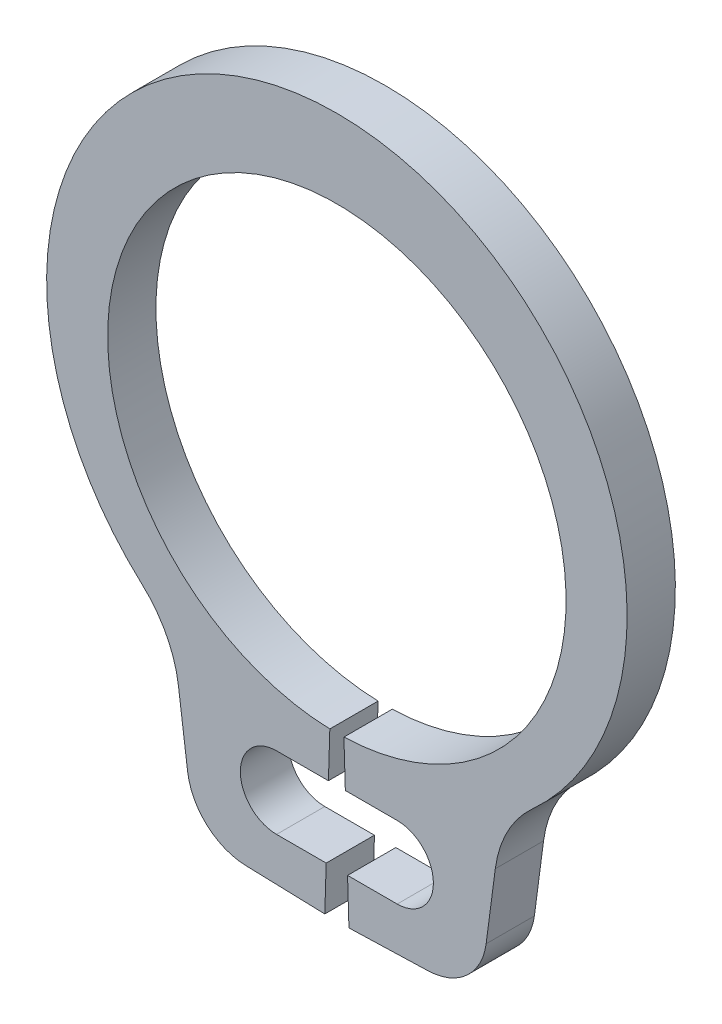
ISO-10303-21;
HEADER;
FILE_DESCRIPTION(('STEP AP214'),'2;1');
FILE_NAME('part.step','',(''),(''),'','','');
FILE_SCHEMA(('AUTOMOTIVE_DESIGN { 1 0 10303 214 1 1 1 1 }'));
ENDSEC;
DATA;
#1=APPLICATION_CONTEXT('core data for automotive mechanical design processes');
#2=APPLICATION_PROTOCOL_DEFINITION('international standard','automotive_design',2000,#1);
#3=PRODUCT_CONTEXT('',#1,'mechanical');
#4=PRODUCT('Part','Part','',(#3));
#5=PRODUCT_RELATED_PRODUCT_CATEGORY('part','',(#4));
#6=PRODUCT_DEFINITION_FORMATION('','',#4);
#7=PRODUCT_DEFINITION_CONTEXT('part definition',#1,'design');
#8=PRODUCT_DEFINITION('design','',#6,#7);
#9=PRODUCT_DEFINITION_SHAPE('','',#8);
#10=(LENGTH_UNIT() NAMED_UNIT(*) SI_UNIT(.MILLI.,.METRE.));
#11=(NAMED_UNIT(*) PLANE_ANGLE_UNIT() SI_UNIT($,.RADIAN.));
#12=(NAMED_UNIT(*) SI_UNIT($,.STERADIAN.) SOLID_ANGLE_UNIT());
#13=UNCERTAINTY_MEASURE_WITH_UNIT(LENGTH_MEASURE(1.E-05),#10,'distance_accuracy_value','');
#14=(GEOMETRIC_REPRESENTATION_CONTEXT(3) GLOBAL_UNCERTAINTY_ASSIGNED_CONTEXT((#13)) GLOBAL_UNIT_ASSIGNED_CONTEXT((#10,
#11,#12)) REPRESENTATION_CONTEXT('',''));
#15=CARTESIAN_POINT('',(0.,0.,0.));
#16=DIRECTION('',(0.,0.,1.));
#17=DIRECTION('',(1.,0.,0.));
#18=AXIS2_PLACEMENT_3D('',#15,#16,#17);
#19=CARTESIAN_POINT('',(-0.0584615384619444,-1.89910037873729,-0.400000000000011));
#20=DIRECTION('',(0.999526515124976,-0.0307692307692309,0.));
#21=DIRECTION('',(0.0307692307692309,0.999526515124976,0.));
#22=AXIS2_PLACEMENT_3D('',#19,#20,#21);
#23=PLANE('',#22);
#24=DIRECTION('',(0.,0.,1.));
#25=VECTOR('',#24,1.);
#26=CARTESIAN_POINT('',(-0.0700929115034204,-2.27694101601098,-0.400000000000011));
#27=LINE('',#26,#25);
#28=CARTESIAN_POINT('',(-0.0700929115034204,-2.27694101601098,-0.400000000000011));
#29=VERTEX_POINT('',#28);
#30=CARTESIAN_POINT('',(-0.0700929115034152,-2.27694101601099,0.));
#31=VERTEX_POINT('',#30);
#32=EDGE_CURVE('E197',#29,#31,#27,.T.);
#33=ORIENTED_EDGE('',*,*,#32,.F.);
#34=DIRECTION('',(0.0307692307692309,0.999526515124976,0.));
#35=VECTOR('',#34,1.);
#36=CARTESIAN_POINT('',(-0.0584615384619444,-1.89910037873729,-0.400000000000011));
#37=LINE('',#36,#35);
#38=CARTESIAN_POINT('',(-0.0584615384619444,-1.89910037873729,-0.400000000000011));
#39=VERTEX_POINT('',#38);
#40=EDGE_CURVE('E279',#29,#39,#37,.T.);
#41=ORIENTED_EDGE('',*,*,#40,.T.);
#42=DIRECTION('',(0.,0.,1.));
#43=VECTOR('',#42,1.);
#44=CARTESIAN_POINT('',(-0.0584615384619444,-1.89910037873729,-0.400000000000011));
#45=LINE('',#44,#43);
#46=CARTESIAN_POINT('',(-0.0584615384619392,-1.89910037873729,0.));
#47=VERTEX_POINT('',#46);
#48=EDGE_CURVE('E11',#39,#47,#45,.T.);
#49=ORIENTED_EDGE('',*,*,#48,.T.);
#50=DIRECTION('',(0.0307692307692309,0.999526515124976,0.));
#51=VECTOR('',#50,1.);
#52=CARTESIAN_POINT('',(-0.0584615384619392,-1.89910037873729,0.));
#53=LINE('',#52,#51);
#54=EDGE_CURVE('E243',#31,#47,#53,.T.);
#55=ORIENTED_EDGE('',*,*,#54,.F.);
#56=EDGE_LOOP('',(#33,#41,#49,#55));
#57=FACE_BOUND('',#56,.T.);
#58=ADVANCED_FACE('F30',(#57),#23,.T.);
#59=CARTESIAN_POINT('',(0.0584615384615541,-1.89910037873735,-0.400000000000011));
#60=DIRECTION('',(-0.999526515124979,-0.0307692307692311,0.));
#61=DIRECTION('',(0.0307692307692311,-0.99952651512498,0.));
#62=AXIS2_PLACEMENT_3D('',#59,#60,#61);
#63=PLANE('',#62);
#64=DIRECTION('',(0.,0.,-1.));
#65=VECTOR('',#64,1.);
#66=CARTESIAN_POINT('',(0.0700929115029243,-2.27694101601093,-0.400000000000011));
#67=LINE('',#66,#65);
#68=CARTESIAN_POINT('',(0.0700929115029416,-2.27694101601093,0.));
#69=VERTEX_POINT('',#68);
#70=CARTESIAN_POINT('',(0.0700929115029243,-2.27694101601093,-0.400000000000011));
#71=VERTEX_POINT('',#70);
#72=EDGE_CURVE('E201',#69,#71,#67,.T.);
#73=ORIENTED_EDGE('',*,*,#72,.F.);
#74=DIRECTION('',(0.0307692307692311,-0.99952651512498,0.));
#75=VECTOR('',#74,1.);
#76=CARTESIAN_POINT('',(0.058461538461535,-1.89910037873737,0.));
#77=LINE('',#76,#75);
#78=CARTESIAN_POINT('',(0.058461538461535,-1.89910037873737,0.));
#79=VERTEX_POINT('',#78);
#80=EDGE_CURVE('E214',#79,#69,#77,.T.);
#81=ORIENTED_EDGE('',*,*,#80,.F.);
#82=DIRECTION('',(0.,0.,1.));
#83=VECTOR('',#82,1.);
#84=CARTESIAN_POINT('',(0.0584615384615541,-1.89910037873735,-0.400000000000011));
#85=LINE('',#84,#83);
#86=CARTESIAN_POINT('',(0.0584615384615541,-1.89910037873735,-0.400000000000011));
#87=VERTEX_POINT('',#86);
#88=EDGE_CURVE('E34',#87,#79,#85,.T.);
#89=ORIENTED_EDGE('',*,*,#88,.F.);
#90=DIRECTION('',(0.0307692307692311,-0.99952651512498,0.));
#91=VECTOR('',#90,1.);
#92=CARTESIAN_POINT('',(0.0584615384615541,-1.89910037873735,-0.400000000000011));
#93=LINE('',#92,#91);
#94=EDGE_CURVE('E249',#87,#71,#93,.T.);
#95=ORIENTED_EDGE('',*,*,#94,.T.);
#96=EDGE_LOOP('',(#73,#81,#89,#95));
#97=FACE_BOUND('',#96,.T.);
#98=ADVANCED_FACE('F313',(#97),#63,.T.);
#99=CARTESIAN_POINT('',(0.,0.,-0.400000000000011));
#100=DIRECTION('',(0.,0.,1.));
#101=DIRECTION('',(1.00000000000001,0.,0.));
#102=AXIS2_PLACEMENT_3D('',#99,#100,#101);
#103=CYLINDRICAL_SURFACE('',#102,1.9);
#104=CARTESIAN_POINT('',(0.,0.,0.));
#105=DIRECTION('',(0.,0.,-1.));
#106=DIRECTION('',(1.00000000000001,0.,0.));
#107=AXIS2_PLACEMENT_3D('',#104,#105,#106);
#108=CIRCLE('',#107,1.9);
#109=EDGE_CURVE('E210',#47,#79,#108,.T.);
#110=ORIENTED_EDGE('',*,*,#109,.F.);
#111=ORIENTED_EDGE('',*,*,#48,.F.);
#112=CARTESIAN_POINT('',(0.,0.,-0.400000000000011));
#113=DIRECTION('',(0.,0.,-1.));
#114=DIRECTION('',(1.00000000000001,0.,0.));
#115=AXIS2_PLACEMENT_3D('',#112,#113,#114);
#116=CIRCLE('',#115,1.9);
#117=EDGE_CURVE('E245',#39,#87,#116,.T.);
#118=ORIENTED_EDGE('',*,*,#117,.T.);
#119=ORIENTED_EDGE('',*,*,#88,.T.);
#120=EDGE_LOOP('',(#110,#111,#118,#119));
#121=FACE_BOUND('',#120,.T.);
#122=ADVANCED_FACE('F32',(#121),#103,.F.);
#123=DIRECTION('',(0.,0.,-1.));
#124=VECTOR('',#123,1.);
#125=CARTESIAN_POINT('',(-0.0885631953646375,-2.87694101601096,-0.400000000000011));
#126=LINE('',#125,#124);
#127=CARTESIAN_POINT('',(-0.0885631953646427,-2.87694101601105,0.));
#128=VERTEX_POINT('',#127);
#129=CARTESIAN_POINT('',(-0.0885631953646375,-2.87694101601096,-0.400000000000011));
#130=VERTEX_POINT('',#129);
#131=EDGE_CURVE('E335',#128,#130,#126,.T.);
#132=ORIENTED_EDGE('',*,*,#131,.F.);
#133=CARTESIAN_POINT('',(-0.100000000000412,-3.2484611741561,0.));
#134=VERTEX_POINT('',#133);
#135=EDGE_CURVE('E191',#134,#128,#53,.T.);
#136=ORIENTED_EDGE('',*,*,#135,.F.);
#137=DIRECTION('',(0.,0.,1.));
#138=VECTOR('',#137,1.);
#139=CARTESIAN_POINT('',(-0.100000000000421,-3.24846117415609,-0.400000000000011));
#140=LINE('',#139,#138);
#141=CARTESIAN_POINT('',(-0.100000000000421,-3.24846117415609,-0.400000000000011));
#142=VERTEX_POINT('',#141);
#143=EDGE_CURVE('E39',#142,#134,#140,.T.);
#144=ORIENTED_EDGE('',*,*,#143,.F.);
#145=EDGE_CURVE('E280',#142,#130,#37,.T.);
#146=ORIENTED_EDGE('',*,*,#145,.T.);
#147=EDGE_LOOP('',(#132,#136,#144,#146));
#148=FACE_BOUND('',#147,.T.);
#149=ADVANCED_FACE('F344',(#148),#23,.T.);
#150=CARTESIAN_POINT('',(-0.100000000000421,-3.24846117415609,-0.400000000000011));
#151=DIRECTION('',(-0.030769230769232,-0.999526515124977,0.));
#152=DIRECTION('',(0.999526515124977,-0.030769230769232,0.));
#153=AXIS2_PLACEMENT_3D('',#150,#151,#152);
#154=PLANE('',#153);
#155=DIRECTION('',(0.999526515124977,-0.030769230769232,0.));
#156=VECTOR('',#155,1.);
#157=CARTESIAN_POINT('',(-0.100000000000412,-3.2484611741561,0.));
#158=LINE('',#157,#156);
#159=CARTESIAN_POINT('',(-0.756909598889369,-3.22823899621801,0.));
#160=VERTEX_POINT('',#159);
#161=EDGE_CURVE('E241',#160,#134,#158,.T.);
#162=ORIENTED_EDGE('',*,*,#161,.F.);
#163=DIRECTION('',(0.,0.,1.));
#164=VECTOR('',#163,1.);
#165=CARTESIAN_POINT('',(-0.756909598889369,-3.22823899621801,-0.400000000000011));
#166=LINE('',#165,#164);
#167=CARTESIAN_POINT('',(-0.756909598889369,-3.22823899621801,-0.400000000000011));
#168=VERTEX_POINT('',#167);
#169=EDGE_CURVE('E284',#168,#160,#166,.T.);
#170=ORIENTED_EDGE('',*,*,#169,.F.);
#171=DIRECTION('',(0.999526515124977,-0.030769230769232,0.));
#172=VECTOR('',#171,1.);
#173=CARTESIAN_POINT('',(-0.100000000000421,-3.24846117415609,-0.400000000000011));
#174=LINE('',#173,#172);
#175=EDGE_CURVE('E276',#168,#142,#174,.T.);
#176=ORIENTED_EDGE('',*,*,#175,.T.);
#177=ORIENTED_EDGE('',*,*,#143,.T.);
#178=EDGE_LOOP('',(#162,#170,#176,#177));
#179=FACE_BOUND('',#178,.T.);
#180=ADVANCED_FACE('F347',(#179),#154,.T.);
#181=CARTESIAN_POINT('',(-0.741524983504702,-2.72847573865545,-0.400000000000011));
#182=DIRECTION('',(0.,0.,1.));
#183=DIRECTION('',(1.00000000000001,0.,0.));
#184=AXIS2_PLACEMENT_3D('',#181,#182,#183);
#185=CYLINDRICAL_SURFACE('',#184,0.5);
#186=CARTESIAN_POINT('',(-0.741524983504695,-2.72847573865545,0.));
#187=DIRECTION('',(0.,0.,1.));
#188=DIRECTION('',(1.00000000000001,0.,0.));
#189=AXIS2_PLACEMENT_3D('',#186,#187,#188);
#190=CIRCLE('',#189,0.5);
#191=CARTESIAN_POINT('',(-1.23724741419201,-2.79373883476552,0.));
#192=VERTEX_POINT('',#191);
#193=EDGE_CURVE('E238',#192,#160,#190,.T.);
#194=ORIENTED_EDGE('',*,*,#193,.F.);
#195=DIRECTION('',(0.,0.,1.));
#196=VECTOR('',#195,1.);
#197=CARTESIAN_POINT('',(-1.23724741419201,-2.79373883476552,-0.400000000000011));
#198=LINE('',#197,#196);
#199=CARTESIAN_POINT('',(-1.23724741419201,-2.79373883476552,-0.400000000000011));
#200=VERTEX_POINT('',#199);
#201=EDGE_CURVE('E286',#200,#192,#198,.T.);
#202=ORIENTED_EDGE('',*,*,#201,.F.);
#203=CARTESIAN_POINT('',(-0.741524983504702,-2.72847573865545,-0.400000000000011));
#204=DIRECTION('',(0.,0.,1.));
#205=DIRECTION('',(1.00000000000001,0.,0.));
#206=AXIS2_PLACEMENT_3D('',#203,#204,#205);
#207=CIRCLE('',#206,0.5);
#208=EDGE_CURVE('E273',#200,#168,#207,.T.);
#209=ORIENTED_EDGE('',*,*,#208,.T.);
#210=ORIENTED_EDGE('',*,*,#169,.T.);
#211=EDGE_LOOP('',(#194,#202,#209,#210));
#212=FACE_BOUND('',#211,.T.);
#213=ADVANCED_FACE('F352',(#212),#185,.T.);
#214=CARTESIAN_POINT('',(-1.31317772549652,-2.21699086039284,-0.400000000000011));
#215=DIRECTION('',(-0.99144486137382,-0.130526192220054,0.));
#216=DIRECTION('',(0.130526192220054,-0.99144486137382,0.));
#217=AXIS2_PLACEMENT_3D('',#214,#215,#216);
#218=PLANE('',#217);
#219=DIRECTION('',(0.130526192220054,-0.99144486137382,0.));
#220=VECTOR('',#219,1.);
#221=CARTESIAN_POINT('',(-1.31317772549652,-2.21699086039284,0.));
#222=LINE('',#221,#220);
#223=CARTESIAN_POINT('',(-1.31317772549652,-2.21699086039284,0.));
#224=VERTEX_POINT('',#223);
#225=EDGE_CURVE('E235',#224,#192,#222,.T.);
#226=ORIENTED_EDGE('',*,*,#225,.F.);
#227=DIRECTION('',(0.,0.,1.));
#228=VECTOR('',#227,1.);
#229=CARTESIAN_POINT('',(-1.31317772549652,-2.21699086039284,-0.400000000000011));
#230=LINE('',#229,#228);
#231=CARTESIAN_POINT('',(-1.31317772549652,-2.21699086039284,-0.400000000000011));
#232=VERTEX_POINT('',#231);
#233=EDGE_CURVE('E288',#232,#224,#230,.T.);
#234=ORIENTED_EDGE('',*,*,#233,.F.);
#235=DIRECTION('',(0.130526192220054,-0.99144486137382,0.));
#236=VECTOR('',#235,1.);
#237=CARTESIAN_POINT('',(-1.31317772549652,-2.21699086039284,-0.400000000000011));
#238=LINE('',#237,#236);
#239=EDGE_CURVE('E270',#232,#200,#238,.T.);
#240=ORIENTED_EDGE('',*,*,#239,.T.);
#241=ORIENTED_EDGE('',*,*,#201,.T.);
#242=EDGE_LOOP('',(#226,#234,#240,#241));
#243=FACE_BOUND('',#242,.T.);
#244=ADVANCED_FACE('F355',(#243),#218,.T.);
#245=CARTESIAN_POINT('',(-2.25446708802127,-2.34091395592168,-0.400000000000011));
#246=DIRECTION('',(0.,0.,1.));
#247=DIRECTION('',(1.00000000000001,0.,0.));
#248=AXIS2_PLACEMENT_3D('',#245,#246,#247);
#249=CYLINDRICAL_SURFACE('',#248,0.94941171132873);
#250=CARTESIAN_POINT('',(-2.25446708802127,-2.34091395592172,0.));
#251=DIRECTION('',(0.,0.,-1.));
#252=DIRECTION('',(1.00000000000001,0.,0.));
#253=AXIS2_PLACEMENT_3D('',#250,#251,#252);
#254=CIRCLE('',#253,0.94941171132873);
#255=CARTESIAN_POINT('',(-1.61654471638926,-1.63775135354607,0.));
#256=VERTEX_POINT('',#255);
#257=EDGE_CURVE('E232',#256,#224,#254,.T.);
#258=ORIENTED_EDGE('',*,*,#257,.F.);
#259=DIRECTION('',(0.,0.,1.));
#260=VECTOR('',#259,1.);
#261=CARTESIAN_POINT('',(-1.61654471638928,-1.63775135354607,-0.400000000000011));
#262=LINE('',#261,#260);
#263=CARTESIAN_POINT('',(-1.61654471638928,-1.63775135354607,-0.400000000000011));
#264=VERTEX_POINT('',#263);
#265=EDGE_CURVE('E290',#264,#256,#262,.T.);
#266=ORIENTED_EDGE('',*,*,#265,.F.);
#267=CARTESIAN_POINT('',(-2.25446708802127,-2.34091395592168,-0.400000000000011));
#268=DIRECTION('',(0.,0.,-1.));
#269=DIRECTION('',(1.00000000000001,0.,0.));
#270=AXIS2_PLACEMENT_3D('',#267,#268,#269);
#271=CIRCLE('',#270,0.94941171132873);
#272=EDGE_CURVE('E267',#264,#232,#271,.T.);
#273=ORIENTED_EDGE('',*,*,#272,.T.);
#274=ORIENTED_EDGE('',*,*,#233,.T.);
#275=EDGE_LOOP('',(#258,#266,#273,#274));
#276=FACE_BOUND('',#275,.T.);
#277=ADVANCED_FACE('F360',(#276),#249,.F.);
#278=CARTESIAN_POINT('',(-4.18068357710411E-13,0.144117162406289,-0.400000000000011));
#279=DIRECTION('',(0.,0.,1.));
#280=DIRECTION('',(1.00000000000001,0.,0.));
#281=AXIS2_PLACEMENT_3D('',#278,#279,#280);
#282=CYLINDRICAL_SURFACE('',#281,2.40588283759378);
#283=CARTESIAN_POINT('',(-4.02455846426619E-13,0.144117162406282,0.));
#284=DIRECTION('',(0.,0.,1.));
#285=DIRECTION('',(1.00000000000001,0.,0.));
#286=AXIS2_PLACEMENT_3D('',#283,#284,#285);
#287=CIRCLE('',#286,2.40588283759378);
#288=CARTESIAN_POINT('',(1.61654471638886,-1.6377513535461,0.));
#289=VERTEX_POINT('',#288);
#290=EDGE_CURVE('E229',#289,#256,#287,.T.);
#291=ORIENTED_EDGE('',*,*,#290,.F.);
#292=DIRECTION('',(0.,0.,1.));
#293=VECTOR('',#292,1.);
#294=CARTESIAN_POINT('',(1.61654471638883,-1.6377513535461,-0.400000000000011));
#295=LINE('',#294,#293);
#296=CARTESIAN_POINT('',(1.61654471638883,-1.6377513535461,-0.400000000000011));
#297=VERTEX_POINT('',#296);
#298=EDGE_CURVE('E292',#297,#289,#295,.T.);
#299=ORIENTED_EDGE('',*,*,#298,.F.);
#300=CARTESIAN_POINT('',(-4.18068357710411E-13,0.144117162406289,-0.400000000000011));
#301=DIRECTION('',(0.,0.,1.));
#302=DIRECTION('',(1.00000000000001,0.,0.));
#303=AXIS2_PLACEMENT_3D('',#300,#301,#302);
#304=CIRCLE('',#303,2.40588283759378);
#305=EDGE_CURVE('E264',#297,#264,#304,.T.);
#306=ORIENTED_EDGE('',*,*,#305,.T.);
#307=ORIENTED_EDGE('',*,*,#265,.T.);
#308=EDGE_LOOP('',(#291,#299,#306,#307));
#309=FACE_BOUND('',#308,.T.);
#310=ADVANCED_FACE('F363',(#309),#282,.T.);
#311=CARTESIAN_POINT('',(2.2544670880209,-2.34091395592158,-0.400000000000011));
#312=DIRECTION('',(0.,0.,1.));
#313=DIRECTION('',(1.00000000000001,0.,0.));
#314=AXIS2_PLACEMENT_3D('',#311,#312,#313);
#315=CYLINDRICAL_SURFACE('',#314,0.94941171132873);
#316=CARTESIAN_POINT('',(2.2544670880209,-2.34091395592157,0.));
#317=DIRECTION('',(0.,0.,-1.));
#318=DIRECTION('',(1.00000000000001,0.,0.));
#319=AXIS2_PLACEMENT_3D('',#316,#317,#318);
#320=CIRCLE('',#319,0.94941171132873);
#321=CARTESIAN_POINT('',(1.3131777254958,-2.21699086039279,0.));
#322=VERTEX_POINT('',#321);
#323=EDGE_CURVE('E226',#322,#289,#320,.T.);
#324=ORIENTED_EDGE('',*,*,#323,.F.);
#325=DIRECTION('',(0.,0.,1.));
#326=VECTOR('',#325,1.);
#327=CARTESIAN_POINT('',(1.31317772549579,-2.21699086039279,-0.400000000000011));
#328=LINE('',#327,#326);
#329=CARTESIAN_POINT('',(1.31317772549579,-2.21699086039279,-0.400000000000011));
#330=VERTEX_POINT('',#329);
#331=EDGE_CURVE('E294',#330,#322,#328,.T.);
#332=ORIENTED_EDGE('',*,*,#331,.F.);
#333=CARTESIAN_POINT('',(2.2544670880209,-2.34091395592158,-0.400000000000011));
#334=DIRECTION('',(0.,0.,-1.));
#335=DIRECTION('',(1.00000000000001,0.,0.));
#336=AXIS2_PLACEMENT_3D('',#333,#334,#335);
#337=CIRCLE('',#336,0.94941171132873);
#338=EDGE_CURVE('E261',#330,#297,#337,.T.);
#339=ORIENTED_EDGE('',*,*,#338,.T.);
#340=ORIENTED_EDGE('',*,*,#298,.T.);
#341=EDGE_LOOP('',(#324,#332,#339,#340));
#342=FACE_BOUND('',#341,.T.);
#343=ADVANCED_FACE('F368',(#342),#315,.F.);
#344=CARTESIAN_POINT('',(1.31317772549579,-2.21699086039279,-0.400000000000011));
#345=DIRECTION('',(0.991444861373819,-0.130526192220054,0.));
#346=DIRECTION('',(0.130526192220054,0.991444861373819,0.));
#347=AXIS2_PLACEMENT_3D('',#344,#345,#346);
#348=PLANE('',#347);
#349=DIRECTION('',(0.130526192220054,0.991444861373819,0.));
#350=VECTOR('',#349,1.);
#351=CARTESIAN_POINT('',(1.3131777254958,-2.21699086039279,0.));
#352=LINE('',#351,#350);
#353=CARTESIAN_POINT('',(1.23724741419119,-2.79373883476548,0.));
#354=VERTEX_POINT('',#353);
#355=EDGE_CURVE('E223',#354,#322,#352,.T.);
#356=ORIENTED_EDGE('',*,*,#355,.F.);
#357=DIRECTION('',(0.,0.,1.));
#358=VECTOR('',#357,1.);
#359=CARTESIAN_POINT('',(1.23724741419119,-2.79373883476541,-0.400000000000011));
#360=LINE('',#359,#358);
#361=CARTESIAN_POINT('',(1.23724741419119,-2.79373883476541,-0.400000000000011));
#362=VERTEX_POINT('',#361);
#363=EDGE_CURVE('E296',#362,#354,#360,.T.);
#364=ORIENTED_EDGE('',*,*,#363,.F.);
#365=DIRECTION('',(0.130526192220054,0.991444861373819,0.));
#366=VECTOR('',#365,1.);
#367=CARTESIAN_POINT('',(1.31317772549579,-2.21699086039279,-0.400000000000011));
#368=LINE('',#367,#366);
#369=EDGE_CURVE('E258',#362,#330,#368,.T.);
#370=ORIENTED_EDGE('',*,*,#369,.T.);
#371=ORIENTED_EDGE('',*,*,#331,.T.);
#372=EDGE_LOOP('',(#356,#364,#370,#371));
#373=FACE_BOUND('',#372,.T.);
#374=ADVANCED_FACE('F371',(#373),#348,.T.);
#375=CARTESIAN_POINT('',(0.741524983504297,-2.72847573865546,-0.400000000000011));
#376=DIRECTION('',(0.,0.,1.));
#377=DIRECTION('',(1.00000000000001,0.,0.));
#378=AXIS2_PLACEMENT_3D('',#375,#376,#377);
#379=CYLINDRICAL_SURFACE('',#378,0.5);
#380=CARTESIAN_POINT('',(0.741524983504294,-2.72847573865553,0.));
#381=DIRECTION('',(0.,0.,1.));
#382=DIRECTION('',(-1.00000000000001,0.,0.));
#383=AXIS2_PLACEMENT_3D('',#380,#381,#382);
#384=CIRCLE('',#383,0.5);
#385=CARTESIAN_POINT('',(0.756909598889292,-3.22823899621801,0.));
#386=VERTEX_POINT('',#385);
#387=EDGE_CURVE('E220',#386,#354,#384,.T.);
#388=ORIENTED_EDGE('',*,*,#387,.F.);
#389=DIRECTION('',(0.,0.,1.));
#390=VECTOR('',#389,1.);
#391=CARTESIAN_POINT('',(0.756909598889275,-3.22823899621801,-0.400000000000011));
#392=LINE('',#391,#390);
#393=CARTESIAN_POINT('',(0.756909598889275,-3.22823899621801,-0.400000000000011));
#394=VERTEX_POINT('',#393);
#395=EDGE_CURVE('E298',#394,#386,#392,.T.);
#396=ORIENTED_EDGE('',*,*,#395,.F.);
#397=CARTESIAN_POINT('',(0.741524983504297,-2.72847573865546,-0.400000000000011));
#398=DIRECTION('',(0.,0.,1.));
#399=DIRECTION('',(-1.00000000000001,0.,0.));
#400=AXIS2_PLACEMENT_3D('',#397,#398,#399);
#401=CIRCLE('',#400,0.5);
#402=EDGE_CURVE('E255',#394,#362,#401,.T.);
#403=ORIENTED_EDGE('',*,*,#402,.T.);
#404=ORIENTED_EDGE('',*,*,#363,.T.);
#405=EDGE_LOOP('',(#388,#396,#403,#404));
#406=FACE_BOUND('',#405,.T.);
#407=ADVANCED_FACE('F376',(#406),#379,.T.);
#408=CARTESIAN_POINT('',(0.0999999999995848,-3.24846117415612,-0.400000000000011));
#409=DIRECTION('',(0.0307692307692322,-0.99952651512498,0.));
#410=DIRECTION('',(0.99952651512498,0.0307692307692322,0.));
#411=AXIS2_PLACEMENT_3D('',#408,#409,#410);
#412=PLANE('',#411);
#413=DIRECTION('',(0.999526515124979,0.0307692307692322,0.));
#414=VECTOR('',#413,1.);
#415=CARTESIAN_POINT('',(0.0999999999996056,-3.24846117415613,0.));
#416=LINE('',#415,#414);
#417=CARTESIAN_POINT('',(0.0999999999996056,-3.24846117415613,0.));
#418=VERTEX_POINT('',#417);
#419=EDGE_CURVE('E217',#418,#386,#416,.T.);
#420=ORIENTED_EDGE('',*,*,#419,.F.);
#421=DIRECTION('',(0.,0.,1.));
#422=VECTOR('',#421,1.);
#423=CARTESIAN_POINT('',(0.0999999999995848,-3.24846117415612,-0.400000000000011));
#424=LINE('',#423,#422);
#425=CARTESIAN_POINT('',(0.0999999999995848,-3.24846117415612,-0.400000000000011));
#426=VERTEX_POINT('',#425);
#427=EDGE_CURVE('E299',#426,#418,#424,.T.);
#428=ORIENTED_EDGE('',*,*,#427,.F.);
#429=DIRECTION('',(0.999526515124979,0.0307692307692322,0.));
#430=VECTOR('',#429,1.);
#431=CARTESIAN_POINT('',(0.0999999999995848,-3.24846117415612,-0.400000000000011));
#432=LINE('',#431,#430);
#433=EDGE_CURVE('E252',#426,#394,#432,.T.);
#434=ORIENTED_EDGE('',*,*,#433,.T.);
#435=ORIENTED_EDGE('',*,*,#395,.T.);
#436=EDGE_LOOP('',(#420,#428,#434,#435));
#437=FACE_BOUND('',#436,.T.);
#438=ADVANCED_FACE('F378',(#437),#412,.T.);
#439=DIRECTION('',(0.,0.,1.));
#440=VECTOR('',#439,1.);
#441=CARTESIAN_POINT('',(0.088563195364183,-2.87694101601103,-0.400000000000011));
#442=LINE('',#441,#440);
#443=CARTESIAN_POINT('',(0.088563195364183,-2.87694101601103,-0.400000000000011));
#444=VERTEX_POINT('',#443);
#445=CARTESIAN_POINT('',(0.0885631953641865,-2.87694101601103,0.));
#446=VERTEX_POINT('',#445);
#447=EDGE_CURVE('E331',#444,#446,#442,.T.);
#448=ORIENTED_EDGE('',*,*,#447,.F.);
#449=EDGE_CURVE('E248',#444,#426,#93,.T.);
#450=ORIENTED_EDGE('',*,*,#449,.T.);
#451=ORIENTED_EDGE('',*,*,#427,.T.);
#452=EDGE_CURVE('E213',#446,#418,#77,.T.);
#453=ORIENTED_EDGE('',*,*,#452,.F.);
#454=EDGE_LOOP('',(#448,#450,#451,#453));
#455=FACE_BOUND('',#454,.T.);
#456=ADVANCED_FACE('F381',(#455),#63,.T.);
#457=CARTESIAN_POINT('',(0.,0.,-0.400000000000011));
#458=DIRECTION('',(0.,0.,1.));
#459=DIRECTION('',(1.00000000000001,0.,0.));
#460=AXIS2_PLACEMENT_3D('',#457,#458,#459);
#461=PLANE('',#460);
#462=CARTESIAN_POINT('',(0.499999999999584,-2.57694101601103,-0.400000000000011));
#463=DIRECTION('',(0.,0.,1.));
#464=DIRECTION('',(1.00000000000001,0.,0.));
#465=AXIS2_PLACEMENT_3D('',#462,#463,#464);
#466=CIRCLE('',#465,0.3);
#467=CARTESIAN_POINT('',(0.499999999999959,-2.87694101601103,-0.400000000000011));
#468=VERTEX_POINT('',#467);
#469=CARTESIAN_POINT('',(0.49999999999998,-2.27694101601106,-0.400000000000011));
#470=VERTEX_POINT('',#469);
#471=EDGE_CURVE('E207',#468,#470,#466,.T.);
#472=ORIENTED_EDGE('',*,*,#471,.T.);
#473=DIRECTION('',(-1.00000000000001,0.,0.));
#474=VECTOR('',#473,1.);
#475=CARTESIAN_POINT('',(-0.500000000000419,-2.27694101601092,-0.400000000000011));
#476=LINE('',#475,#474);
#477=EDGE_CURVE('E55',#470,#71,#476,.T.);
#478=ORIENTED_EDGE('',*,*,#477,.T.);
#479=ORIENTED_EDGE('',*,*,#94,.F.);
#480=ORIENTED_EDGE('',*,*,#117,.F.);
#481=ORIENTED_EDGE('',*,*,#40,.F.);
#482=CARTESIAN_POINT('',(-0.500000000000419,-2.27694101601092,-0.400000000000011));
#483=VERTEX_POINT('',#482);
#484=EDGE_CURVE('E192',#29,#483,#476,.T.);
#485=ORIENTED_EDGE('',*,*,#484,.T.);
#486=CARTESIAN_POINT('',(-0.500000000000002,-2.57694101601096,-0.400000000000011));
#487=DIRECTION('',(0.,0.,1.));
#488=DIRECTION('',(1.00000000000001,0.,0.));
#489=AXIS2_PLACEMENT_3D('',#486,#487,#488);
#490=CIRCLE('',#489,0.3);
#491=CARTESIAN_POINT('',(-0.500000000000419,-2.87694101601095,-0.400000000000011));
#492=VERTEX_POINT('',#491);
#493=EDGE_CURVE('E196',#483,#492,#490,.T.);
#494=ORIENTED_EDGE('',*,*,#493,.T.);
#495=DIRECTION('',(1.00000000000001,0.,0.));
#496=VECTOR('',#495,1.);
#497=CARTESIAN_POINT('',(0.499999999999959,-2.87694101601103,-0.400000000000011));
#498=LINE('',#497,#496);
#499=EDGE_CURVE('E174',#492,#130,#498,.T.);
#500=ORIENTED_EDGE('',*,*,#499,.T.);
#501=ORIENTED_EDGE('',*,*,#145,.F.);
#502=ORIENTED_EDGE('',*,*,#175,.F.);
#503=ORIENTED_EDGE('',*,*,#208,.F.);
#504=ORIENTED_EDGE('',*,*,#239,.F.);
#505=ORIENTED_EDGE('',*,*,#272,.F.);
#506=ORIENTED_EDGE('',*,*,#305,.F.);
#507=ORIENTED_EDGE('',*,*,#338,.F.);
#508=ORIENTED_EDGE('',*,*,#369,.F.);
#509=ORIENTED_EDGE('',*,*,#402,.F.);
#510=ORIENTED_EDGE('',*,*,#433,.F.);
#511=ORIENTED_EDGE('',*,*,#449,.F.);
#512=EDGE_CURVE('E324',#444,#468,#498,.T.);
#513=ORIENTED_EDGE('',*,*,#512,.T.);
#514=EDGE_LOOP('',(#472,#478,#479,#480,#481,#485,#494,#500,#501,#502,#503,#504,#505,#506,#507,
#508,#509,#510,#511,#513));
#515=FACE_BOUND('',#514,.T.);
#516=ADVANCED_FACE('F320',(#515),#461,.F.);
#517=CARTESIAN_POINT('',(0.,0.,0.));
#518=DIRECTION('',(0.,0.,1.));
#519=DIRECTION('',(1.00000000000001,0.,0.));
#520=AXIS2_PLACEMENT_3D('',#517,#518,#519);
#521=PLANE('',#520);
#522=DIRECTION('',(-1.00000000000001,0.,0.));
#523=VECTOR('',#522,1.);
#524=CARTESIAN_POINT('',(-0.500000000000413,-2.27694101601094,0.));
#525=LINE('',#524,#523);
#526=CARTESIAN_POINT('',(0.49999999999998,-2.27694101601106,0.));
#527=VERTEX_POINT('',#526);
#528=EDGE_CURVE('E337',#527,#69,#525,.T.);
#529=ORIENTED_EDGE('',*,*,#528,.F.);
#530=CARTESIAN_POINT('',(0.499999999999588,-2.57694101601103,0.));
#531=DIRECTION('',(0.,0.,1.));
#532=DIRECTION('',(1.00000000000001,0.,0.));
#533=AXIS2_PLACEMENT_3D('',#530,#531,#532);
#534=CIRCLE('',#533,0.3);
#535=CARTESIAN_POINT('',(0.499999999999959,-2.87694101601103,0.));
#536=VERTEX_POINT('',#535);
#537=EDGE_CURVE('E199',#536,#527,#534,.T.);
#538=ORIENTED_EDGE('',*,*,#537,.F.);
#539=DIRECTION('',(1.00000000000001,0.,0.));
#540=VECTOR('',#539,1.);
#541=CARTESIAN_POINT('',(0.499999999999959,-2.87694101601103,0.));
#542=LINE('',#541,#540);
#543=EDGE_CURVE('E47',#446,#536,#542,.T.);
#544=ORIENTED_EDGE('',*,*,#543,.F.);
#545=ORIENTED_EDGE('',*,*,#452,.T.);
#546=ORIENTED_EDGE('',*,*,#419,.T.);
#547=ORIENTED_EDGE('',*,*,#387,.T.);
#548=ORIENTED_EDGE('',*,*,#355,.T.);
#549=ORIENTED_EDGE('',*,*,#323,.T.);
#550=ORIENTED_EDGE('',*,*,#290,.T.);
#551=ORIENTED_EDGE('',*,*,#257,.T.);
#552=ORIENTED_EDGE('',*,*,#225,.T.);
#553=ORIENTED_EDGE('',*,*,#193,.T.);
#554=ORIENTED_EDGE('',*,*,#161,.T.);
#555=ORIENTED_EDGE('',*,*,#135,.T.);
#556=CARTESIAN_POINT('',(-0.500000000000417,-2.87694101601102,0.));
#557=VERTEX_POINT('',#556);
#558=EDGE_CURVE('E171',#557,#128,#542,.T.);
#559=ORIENTED_EDGE('',*,*,#558,.F.);
#560=CARTESIAN_POINT('',(-0.500000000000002,-2.57694101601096,0.));
#561=DIRECTION('',(0.,0.,1.));
#562=DIRECTION('',(1.00000000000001,0.,0.));
#563=AXIS2_PLACEMENT_3D('',#560,#561,#562);
#564=CIRCLE('',#563,0.3);
#565=CARTESIAN_POINT('',(-0.500000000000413,-2.27694101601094,0.));
#566=VERTEX_POINT('',#565);
#567=EDGE_CURVE('E188',#566,#557,#564,.T.);
#568=ORIENTED_EDGE('',*,*,#567,.F.);
#569=EDGE_CURVE('E315',#31,#566,#525,.T.);
#570=ORIENTED_EDGE('',*,*,#569,.F.);
#571=ORIENTED_EDGE('',*,*,#54,.T.);
#572=ORIENTED_EDGE('',*,*,#109,.T.);
#573=ORIENTED_EDGE('',*,*,#80,.T.);
#574=EDGE_LOOP('',(#529,#538,#544,#545,#546,#547,#548,#549,#550,#551,#552,#553,#554,#555,#559,
#568,#570,#571,#572,#573));
#575=FACE_BOUND('',#574,.T.);
#576=ADVANCED_FACE('F186',(#575),#521,.T.);
#577=CARTESIAN_POINT('',(0.499999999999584,-2.57694101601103,-0.400000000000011));
#578=DIRECTION('',(0.,0.,1.));
#579=DIRECTION('',(1.00000000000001,0.,0.));
#580=AXIS2_PLACEMENT_3D('',#577,#578,#579);
#581=CYLINDRICAL_SURFACE('',#580,0.3);
#582=ORIENTED_EDGE('',*,*,#537,.T.);
#583=DIRECTION('',(0.,0.,1.));
#584=VECTOR('',#583,1.);
#585=CARTESIAN_POINT('',(0.49999999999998,-2.27694101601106,-0.400000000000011));
#586=LINE('',#585,#584);
#587=EDGE_CURVE('E329',#470,#527,#586,.T.);
#588=ORIENTED_EDGE('',*,*,#587,.F.);
#589=ORIENTED_EDGE('',*,*,#471,.F.);
#590=DIRECTION('',(0.,0.,1.));
#591=VECTOR('',#590,1.);
#592=CARTESIAN_POINT('',(0.499999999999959,-2.87694101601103,-0.400000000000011));
#593=LINE('',#592,#591);
#594=EDGE_CURVE('E179',#468,#536,#593,.T.);
#595=ORIENTED_EDGE('',*,*,#594,.T.);
#596=EDGE_LOOP('',(#582,#588,#589,#595));
#597=FACE_BOUND('',#596,.T.);
#598=ADVANCED_FACE('F384',(#597),#581,.F.);
#599=CARTESIAN_POINT('',(-0.500000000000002,-2.57694101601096,-0.400000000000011));
#600=DIRECTION('',(0.,0.,1.));
#601=DIRECTION('',(1.00000000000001,0.,0.));
#602=AXIS2_PLACEMENT_3D('',#599,#600,#601);
#603=CYLINDRICAL_SURFACE('',#602,0.3);
#604=ORIENTED_EDGE('',*,*,#567,.T.);
#605=DIRECTION('',(0.,0.,1.));
#606=VECTOR('',#605,1.);
#607=CARTESIAN_POINT('',(-0.500000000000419,-2.87694101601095,-0.400000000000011));
#608=LINE('',#607,#606);
#609=EDGE_CURVE('E168',#492,#557,#608,.T.);
#610=ORIENTED_EDGE('',*,*,#609,.F.);
#611=ORIENTED_EDGE('',*,*,#493,.F.);
#612=DIRECTION('',(0.,0.,1.));
#613=VECTOR('',#612,1.);
#614=CARTESIAN_POINT('',(-0.500000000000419,-2.27694101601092,-0.400000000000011));
#615=LINE('',#614,#613);
#616=EDGE_CURVE('E180',#483,#566,#615,.T.);
#617=ORIENTED_EDGE('',*,*,#616,.T.);
#618=EDGE_LOOP('',(#604,#610,#611,#617));
#619=FACE_BOUND('',#618,.T.);
#620=ADVANCED_FACE('F195',(#619),#603,.F.);
#621=CARTESIAN_POINT('',(-0.500000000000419,-2.27694101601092,-0.400000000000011));
#622=DIRECTION('',(0.,1.00000000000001,0.));
#623=DIRECTION('',(0.,0.,1.));
#624=AXIS2_PLACEMENT_3D('',#621,#622,#623);
#625=PLANE('',#624);
#626=ORIENTED_EDGE('',*,*,#32,.T.);
#627=ORIENTED_EDGE('',*,*,#569,.T.);
#628=ORIENTED_EDGE('',*,*,#616,.F.);
#629=ORIENTED_EDGE('',*,*,#484,.F.);
#630=EDGE_LOOP('',(#626,#627,#628,#629));
#631=FACE_BOUND('',#630,.T.);
#632=ADVANCED_FACE('F340',(#631),#625,.F.);
#633=CARTESIAN_POINT('',(0.499999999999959,-2.87694101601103,-0.400000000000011));
#634=DIRECTION('',(0.,-1.00000000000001,0.));
#635=DIRECTION('',(0.,0.,-1.));
#636=AXIS2_PLACEMENT_3D('',#633,#634,#635);
#637=PLANE('',#636);
#638=ORIENTED_EDGE('',*,*,#131,.T.);
#639=ORIENTED_EDGE('',*,*,#499,.F.);
#640=ORIENTED_EDGE('',*,*,#609,.T.);
#641=ORIENTED_EDGE('',*,*,#558,.T.);
#642=EDGE_LOOP('',(#638,#639,#640,#641));
#643=FACE_BOUND('',#642,.T.);
#644=ADVANCED_FACE('F170',(#643),#637,.F.);
#645=ORIENTED_EDGE('',*,*,#447,.T.);
#646=ORIENTED_EDGE('',*,*,#543,.T.);
#647=ORIENTED_EDGE('',*,*,#594,.F.);
#648=ORIENTED_EDGE('',*,*,#512,.F.);
#649=EDGE_LOOP('',(#645,#646,#647,#648));
#650=FACE_BOUND('',#649,.T.);
#651=ADVANCED_FACE('F382',(#650),#637,.F.);
#652=ORIENTED_EDGE('',*,*,#72,.T.);
#653=ORIENTED_EDGE('',*,*,#477,.F.);
#654=ORIENTED_EDGE('',*,*,#587,.T.);
#655=ORIENTED_EDGE('',*,*,#528,.T.);
#656=EDGE_LOOP('',(#652,#653,#654,#655));
#657=FACE_BOUND('',#656,.T.);
#658=ADVANCED_FACE('F336',(#657),#625,.F.);
#659=CLOSED_SHELL('',(#58,#98,#122,#149,#180,#213,#244,#277,#310,#343,#374,#407,#438,#456,#516,
#576,#598,#620,#632,#644,#651,#658));
#660=MANIFOLD_SOLID_BREP('B2',#659);
#661=ADVANCED_BREP_SHAPE_REPRESENTATION('',(#18,#660),#14);
#662=SHAPE_DEFINITION_REPRESENTATION(#9,#661);
ENDSEC;
END-ISO-10303-21;
